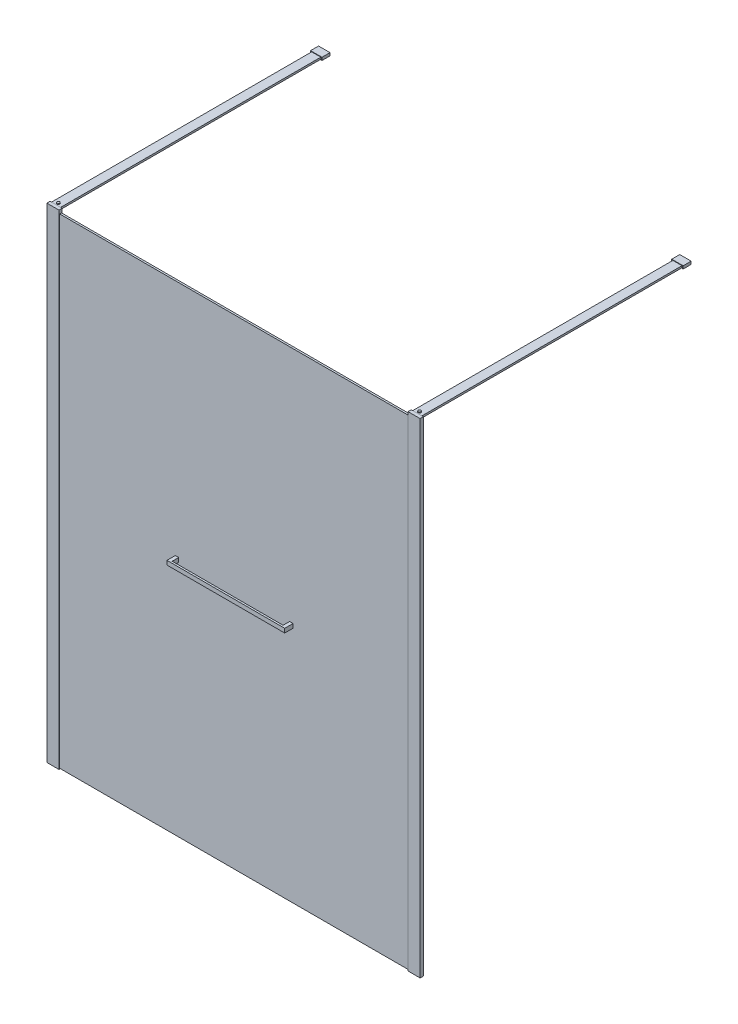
from build123d import *

# Parameters (mm, degrees)
DODANIE_WYCI_GNI_CIE1_START         = 3
DODANIE_WYCI_GNI_CIE1_DEPTH         = 2100
SZKIC2_W                            = 1547
SZKIC2_H                            = 8
DODANIE_WYCI_GNI_CIE2_DEPTH         = 2100
DODANIE_WYCI_GNI_CIE3_DEPTH         = 2100
SZKIC4_W                            = 53
SZKIC4_H                            = 14
DODANIE_WYCI_GNI_CIE4_DEPTH         = 16
SZKIC5_W                            = 53
SZKIC5_H                            = 14
DODANIE_WYCI_GNI_CIE5_DEPTH         = 16
SZKIC7_W                            = 53
SZKIC7_H                            = 14
DODANIE_WYCI_GNI_CIE7_DEPTH         = 3
SZKIC8_W                            = 53
SZKIC8_H                            = 14
DODANIE_WYCI_GNI_CIE8_DEPTH         = 3
SZKIC9_W                            = 40
SZKIC9_H                            = 8
DODANIE_WYCI_GNI_CIE9_DEPTH         = 1170
DODANIE_WYCI_GNI_CIE9_2_DEPTH       = 1170
DODANIE_WYCI_GNI_CIE10_START        = -32
SZKIC10_W                           = 50
SZKIC10_H                           = 12.5
DODANIE_WYCI_GNI_CIE10_DEPTH        = 35
DODANIE_WYCI_GNI_CIE11_DEPTH        = 36.5
DODANIE_WYCI_GNI_CIE11_DEPTH_BACK   = 18
SZKIC12_W                           = 15
SZKIC12_H                           = 18
DODANIE_WYCI_GNI_CIE11_2_DEPTH      = 36.5
DODANIE_WYCI_GNI_CIE11_2_DEPTH_BACK = 18
SZKIC13_W                           = 8
SZKIC13_H                           = 18
DODANIE_WYCI_GNI_CIE12_DEPTH        = 485


with BuildPart() as part:
    # Szkic1 → Dodanie-wyci_gni_cie1 (new body)
    with BuildSketch(Plane(origin=(0, 0, 0), x_dir=(1, 0, 0), z_dir=(0, 1, 0)).offset(DODANIE_WYCI_GNI_CIE1_START)):
        Polygon((0, 0), (0, 14), (53, 14), (53, 11), (42.9, 11), (42.9, 3), (53, 3), (53, 0), align=None)
    extrude(amount=DODANIE_WYCI_GNI_CIE1_DEPTH)

    # Szkic4 → Dodanie-wyci_gni_cie4 (add)
    with BuildSketch(Plane(origin=(0, 2103, 0), x_dir=(1, 0, 0), z_dir=(0, 1, 0))):
        with Locations((26.5, 7)):
            Rectangle(SZKIC4_W, SZKIC4_H)
    extrude(amount=DODANIE_WYCI_GNI_CIE4_DEPTH)

    # Szkic8 → Dodanie-wyci_gni_cie8 (add)
    with BuildSketch(Plane.XZ.offset(-3)):
        with Locations((26.5, -7)):
            Rectangle(SZKIC8_W, SZKIC8_H)
    extrude(amount=DODANIE_WYCI_GNI_CIE8_DEPTH)


with BuildPart() as body_2:
    # Szkic2 → Dodanie-wyci_gni_cie2 (new body)
    with BuildSketch(Plane.XZ.offset(-3)):
        with Locations((816.4, -7)):
            Rectangle(SZKIC2_W, SZKIC2_H)
    extrude(amount=-DODANIE_WYCI_GNI_CIE2_DEPTH)


with BuildPart() as body_3:
    # Szkic3 → Dodanie-wyci_gni_cie3 (new body)
    with BuildSketch(Plane.XZ.offset(-3)):
        Polygon((1579.8, -3), (1579.8, 0), (1632.8, 0), (1632.8, -14), (1579.8, -14), (1579.8, -11), (1589.9, -11), (1589.9, -3), align=None)
    extrude(amount=-DODANIE_WYCI_GNI_CIE3_DEPTH)

    # Szkic5 → Dodanie-wyci_gni_cie5 (add)
    with BuildSketch(Plane(origin=(0, 2103, 0), x_dir=(1, 0, 0), z_dir=(0, 1, 0))):
        with Locations((1606.3, 7)):
            Rectangle(SZKIC5_W, SZKIC5_H)
    extrude(amount=DODANIE_WYCI_GNI_CIE5_DEPTH)

    # Szkic7 → Dodanie-wyci_gni_cie7 (add)
    with BuildSketch(Plane.XZ.offset(-3)):
        with Locations((1606.3, -7)):
            Rectangle(SZKIC7_W, SZKIC7_H)
    extrude(amount=DODANIE_WYCI_GNI_CIE7_DEPTH)


with BuildPart() as body_4:
    # Szkic9 → Dodanie-wyci_gni_cie9 (new body)
    with BuildSketch(Plane(origin=(0, 0, -14), x_dir=(-1, 0, 0), z_dir=(0, 0, -1))):
        with Locations((-1606.3, 2115)):
            Rectangle(SZKIC9_W, SZKIC9_H)
    extrude(amount=DODANIE_WYCI_GNI_CIE9_DEPTH)



with BuildPart() as body_5:
    # Szkic9 → Dodanie-wyci_gni_cie9 2 (new body)
    with BuildSketch(Plane(origin=(0, 0, -14), x_dir=(-1, 0, 0), z_dir=(0, 0, -1))):
        with Locations((-26.5, 2115)):
            Rectangle(SZKIC9_W, SZKIC9_H)
    extrude(amount=DODANIE_WYCI_GNI_CIE9_2_DEPTH)


with BuildPart() as body_4_1:
    add(body_4.part)

    add(body_5.part)  # Dodanie-wyci_gni_cie10 merges body 5
    # Szkic10 → Dodanie-wyci_gni_cie10 (add)
    with BuildSketch(Plane(origin=(0, 0, -1184), x_dir=(-1, 0, 0), z_dir=(0, 0, -1)).offset(DODANIE_WYCI_GNI_CIE10_START)):
        with Locations((-1606.3, 2115)):
            Rectangle(SZKIC10_W, SZKIC10_H)
        with Locations((-26.5, 2115)):
            Rectangle(SZKIC10_W, SZKIC10_H)
    extrude(amount=DODANIE_WYCI_GNI_CIE10_DEPTH)

    # Szkic11 → Obr_t1 (revolve)
    with BuildSketch(Plane(origin=(1606.3, 0, 0), x_dir=(0, 0, -1), z_dir=(1, 0, 0))):
        with BuildLine():
            Line((29.9, 2119), (29.65, 2122.8))
            ThreePointArc((29.65, 2122.8), (26.98045718, 2124.212280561), (24, 2124.7))
            Line((24, 2124.7), (24, 2124.2))
            ThreePointArc((24, 2124.2), (26.713886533, 2123.773650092), (29.166308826, 2122.535676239))
            Line((29.166308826, 2122.535676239), (29.398919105, 2119))
            Line((29.398919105, 2119), (29.9, 2119))
        make_face()
    revolve(axis=Axis((1606.3, 2119, -24), (0, 1, 0)))

    # Szkic14 → Obr_t2 (revolve)
    with BuildSketch(Plane(origin=(26.5, 0, 0), x_dir=(0, 0, -1), z_dir=(1, 0, 0))):
        with BuildLine():
            Line((29.9, 2119), (29.65, 2122.8))
            ThreePointArc((29.65, 2122.8), (26.98045718, 2124.212280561), (24, 2124.7))
            Line((24, 2124.7), (24, 2124.2))
            ThreePointArc((24, 2124.2), (26.713886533, 2123.773650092), (29.166308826, 2122.535676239))
            Line((29.166308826, 2122.535676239), (29.398919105, 2119))
            Line((29.398919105, 2119), (29.9, 2119))
        make_face()
    revolve(axis=Axis((26.5, 2119, -24), (0, 1, 0)))


with BuildPart() as body_5_2:
    # Szkic12 → Dodanie-wyci_gni_cie11 (new, two sides: drawn at the far end of the back side and taken through both)
    with BuildSketch(Plane.XY.offset(-3).offset(-DODANIE_WYCI_GNI_CIE11_DEPTH_BACK)):
        with Locations((566.4, 1053)):
            Rectangle(SZKIC12_W, SZKIC12_H)
    extrude(amount=DODANIE_WYCI_GNI_CIE11_DEPTH + DODANIE_WYCI_GNI_CIE11_DEPTH_BACK)



with BuildPart() as body_6:
    # Szkic12 → Dodanie-wyci_gni_cie11 2 (new, two sides: drawn at the far end of the back side and taken through both)
    with BuildSketch(Plane.XY.offset(-3).offset(-DODANIE_WYCI_GNI_CIE11_2_DEPTH_BACK)):
        with Locations((1066.4, 1053)):
            Rectangle(SZKIC12_W, SZKIC12_H)
    extrude(amount=DODANIE_WYCI_GNI_CIE11_2_DEPTH + DODANIE_WYCI_GNI_CIE11_2_DEPTH_BACK)


with BuildPart() as body_5_2_1:
    add(body_5_2.part)

    add(body_6.part)  # Dodanie-wyci_gni_cie12 merges body 6
    # Szkic13 → Dodanie-wyci_gni_cie12 (add)
    with BuildSketch(Plane(origin=(573.9, 0, 0), x_dir=(0, 0, -1), z_dir=(1, 0, 0))):
        with Locations((-29.5, 1053)):
            Rectangle(SZKIC13_W, SZKIC13_H)
    extrude(amount=DODANIE_WYCI_GNI_CIE12_DEPTH)


solid = Compound([part.part, body_2.part, body_3.part, body_4_1.part, body_5_2_1.part])
